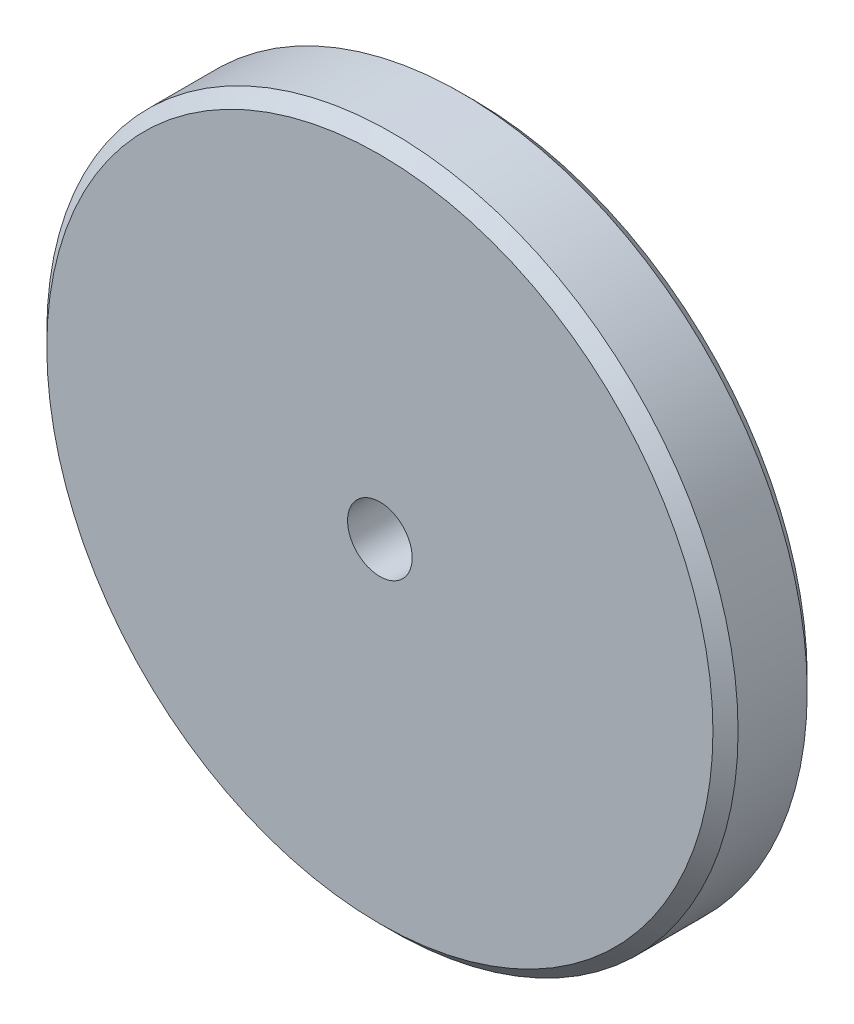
from build123d import *

# Parameters (mm, degrees)
SKETCH1_R                = 34.925
BOSS_EXTRUDE1_DEPTH      = 9.525
CHAMFER1_SIZE            = 1.27
F_0_257_DIAMETER_HOLE1_D = 6.5278


with BuildPart() as part:
    # Sketch1 → Boss-Extrude1 (new body)
    with BuildSketch(Plane.XY):
        with Locations(Location((0, 0, 0), (0, 0, 180))):
            Circle(SKETCH1_R)
    extrude(amount=BOSS_EXTRUDE1_DEPTH)

    # Chamfer1
    chamfer1_edges = [part.edges().sort_by_distance(p)[0] for p in [
        (34.925, 0, 0),
        (34.925, 0, 9.525),
    ]]
    chamfer(chamfer1_edges, length=CHAMFER1_SIZE)

    # F _0.257_ Diameter Hole1 (through all)
    with Locations(Plane.XY.offset(9.525)):
        with Locations((0, 0)):
            Hole(F_0_257_DIAMETER_HOLE1_D / 2)


solid = part.part
